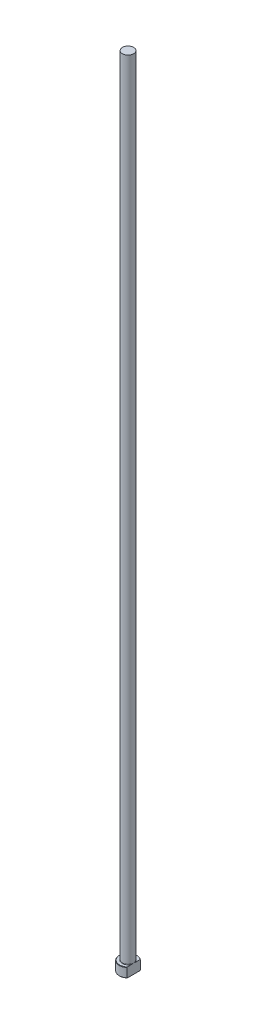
ISO-10303-21;
HEADER;
FILE_DESCRIPTION(('STEP AP214'),'2;1');
FILE_NAME('part.step','',(''),(''),'','','');
FILE_SCHEMA(('AUTOMOTIVE_DESIGN { 1 0 10303 214 1 1 1 1 }'));
ENDSEC;
DATA;
#1=APPLICATION_CONTEXT('core data for automotive mechanical design processes');
#2=APPLICATION_PROTOCOL_DEFINITION('international standard','automotive_design',2000,#1);
#3=PRODUCT_CONTEXT('',#1,'mechanical');
#4=PRODUCT('Part','Part','',(#3));
#5=PRODUCT_RELATED_PRODUCT_CATEGORY('part','',(#4));
#6=PRODUCT_DEFINITION_FORMATION('','',#4);
#7=PRODUCT_DEFINITION_CONTEXT('part definition',#1,'design');
#8=PRODUCT_DEFINITION('design','',#6,#7);
#9=PRODUCT_DEFINITION_SHAPE('','',#8);
#10=(LENGTH_UNIT() NAMED_UNIT(*) SI_UNIT(.MILLI.,.METRE.));
#11=(NAMED_UNIT(*) PLANE_ANGLE_UNIT() SI_UNIT($,.RADIAN.));
#12=(NAMED_UNIT(*) SI_UNIT($,.STERADIAN.) SOLID_ANGLE_UNIT());
#13=UNCERTAINTY_MEASURE_WITH_UNIT(LENGTH_MEASURE(1.E-05),#10,'distance_accuracy_value','');
#14=(GEOMETRIC_REPRESENTATION_CONTEXT(3) GLOBAL_UNCERTAINTY_ASSIGNED_CONTEXT((#13)) GLOBAL_UNIT_ASSIGNED_CONTEXT((#10,
#11,#12)) REPRESENTATION_CONTEXT('',''));
#15=CARTESIAN_POINT('',(0.,0.,0.));
#16=DIRECTION('',(0.,0.,1.));
#17=DIRECTION('',(1.,0.,0.));
#18=AXIS2_PLACEMENT_3D('',#15,#16,#17);
#19=CARTESIAN_POINT('',(0.,0.,0.));
#20=DIRECTION('',(0.,-1.,0.));
#21=DIRECTION('',(0.,0.,-1.));
#22=AXIS2_PLACEMENT_3D('',#19,#20,#21);
#23=PLANE('',#22);
#24=CARTESIAN_POINT('',(0.,0.,0.));
#25=DIRECTION('',(0.,-1.,0.));
#26=DIRECTION('',(0.,0.,-1.));
#27=AXIS2_PLACEMENT_3D('',#24,#25,#26);
#28=CIRCLE('',#27,5.29999999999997);
#29=CARTESIAN_POINT('',(3.49999999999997,0.,3.97994974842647));
#30=VERTEX_POINT('',#29);
#31=CARTESIAN_POINT('',(3.49999999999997,0.,-3.97994974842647));
#32=VERTEX_POINT('',#31);
#33=EDGE_CURVE('E98',#30,#32,#28,.T.);
#34=ORIENTED_EDGE('',*,*,#33,.T.);
#35=DIRECTION('',(0.,0.,1.));
#36=VECTOR('',#35,1.);
#37=CARTESIAN_POINT('',(3.49999999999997,0.,4.24264068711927));
#38=LINE('',#37,#36);
#39=EDGE_CURVE('E83',#32,#30,#38,.T.);
#40=ORIENTED_EDGE('',*,*,#39,.T.);
#41=EDGE_LOOP('',(#34,#40));
#42=FACE_BOUND('',#41,.T.);
#43=ADVANCED_FACE('F32',(#42),#23,.T.);
#44=CARTESIAN_POINT('',(0.,259.958771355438,0.));
#45=DIRECTION('',(0.,1.,0.));
#46=DIRECTION('',(0.,0.,1.));
#47=AXIS2_PLACEMENT_3D('',#44,#45,#46);
#48=CYLINDRICAL_SURFACE('',#47,5.49999999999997);
#49=CARTESIAN_POINT('',(0.,5.79999999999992,0.));
#50=DIRECTION('',(0.,1.,0.));
#51=DIRECTION('',(0.,0.,1.));
#52=AXIS2_PLACEMENT_3D('',#49,#50,#51);
#53=CIRCLE('',#52,5.49999999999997);
#54=CARTESIAN_POINT('',(3.49999999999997,5.79999999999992,4.24264068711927));
#55=VERTEX_POINT('',#54);
#56=CARTESIAN_POINT('',(3.49999999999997,5.79999999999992,-4.24264068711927));
#57=VERTEX_POINT('',#56);
#58=EDGE_CURVE('E104',#55,#57,#53,.F.);
#59=ORIENTED_EDGE('',*,*,#58,.T.);
#60=DIRECTION('',(0.,-1.,0.));
#61=VECTOR('',#60,1.);
#62=CARTESIAN_POINT('',(3.49999999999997,500.,-4.24264068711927));
#63=LINE('',#62,#61);
#64=CARTESIAN_POINT('',(3.49999999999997,0.199999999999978,-4.24264068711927));
#65=VERTEX_POINT('',#64);
#66=EDGE_CURVE('E183',#57,#65,#63,.T.);
#67=ORIENTED_EDGE('',*,*,#66,.T.);
#68=CARTESIAN_POINT('',(0.,0.199999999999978,0.));
#69=DIRECTION('',(0.,-1.,0.));
#70=DIRECTION('',(0.,0.,-1.));
#71=AXIS2_PLACEMENT_3D('',#68,#69,#70);
#72=CIRCLE('',#71,5.49999999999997);
#73=CARTESIAN_POINT('',(3.49999999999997,0.199999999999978,4.24264068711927));
#74=VERTEX_POINT('',#73);
#75=EDGE_CURVE('E100',#65,#74,#72,.F.);
#76=ORIENTED_EDGE('',*,*,#75,.T.);
#77=DIRECTION('',(0.,-1.,0.));
#78=VECTOR('',#77,1.);
#79=CARTESIAN_POINT('',(3.49999999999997,500.,4.24264068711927));
#80=LINE('',#79,#78);
#81=EDGE_CURVE('E93',#55,#74,#80,.T.);
#82=ORIENTED_EDGE('',*,*,#81,.F.);
#83=EDGE_LOOP('',(#59,#67,#76,#82));
#84=FACE_BOUND('',#83,.T.);
#85=ADVANCED_FACE('F158',(#84),#48,.T.);
#86=CARTESIAN_POINT('',(-5.49999999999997,6.,0.));
#87=DIRECTION('',(0.,1.,0.));
#88=DIRECTION('',(0.,0.,1.));
#89=AXIS2_PLACEMENT_3D('',#86,#87,#88);
#90=PLANE('',#89);
#91=CARTESIAN_POINT('',(0.,6.,0.));
#92=DIRECTION('',(0.,1.,0.));
#93=DIRECTION('',(0.,0.,1.));
#94=AXIS2_PLACEMENT_3D('',#91,#92,#93);
#95=CIRCLE('',#94,5.29999999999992);
#96=CARTESIAN_POINT('',(3.49999999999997,6.,-3.9799497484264));
#97=VERTEX_POINT('',#96);
#98=CARTESIAN_POINT('',(3.49999999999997,6.,3.9799497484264));
#99=VERTEX_POINT('',#98);
#100=EDGE_CURVE('E178',#97,#99,#95,.T.);
#101=ORIENTED_EDGE('',*,*,#100,.T.);
#102=DIRECTION('',(0.,0.,-1.));
#103=VECTOR('',#102,1.);
#104=CARTESIAN_POINT('',(3.49999999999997,6.,0.));
#105=LINE('',#104,#103);
#106=CARTESIAN_POINT('',(3.49999999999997,5.99999999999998,1.19999999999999));
#107=VERTEX_POINT('',#106);
#108=EDGE_CURVE('E57',#99,#107,#105,.T.);
#109=ORIENTED_EDGE('',*,*,#108,.T.);
#110=CARTESIAN_POINT('',(0.,6.,0.));
#111=DIRECTION('',(0.,1.,0.));
#112=DIRECTION('',(0.,0.,1.));
#113=AXIS2_PLACEMENT_3D('',#110,#111,#112);
#114=CIRCLE('',#113,3.69999999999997);
#115=CARTESIAN_POINT('',(3.49999999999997,5.99999999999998,-1.19999999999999));
#116=VERTEX_POINT('',#115);
#117=EDGE_CURVE('E107',#107,#116,#114,.F.);
#118=ORIENTED_EDGE('',*,*,#117,.T.);
#119=EDGE_CURVE('E136',#116,#97,#105,.T.);
#120=ORIENTED_EDGE('',*,*,#119,.T.);
#121=EDGE_LOOP('',(#101,#109,#118,#120));
#122=FACE_BOUND('',#121,.T.);
#123=ADVANCED_FACE('F147',(#122),#90,.T.);
#124=CARTESIAN_POINT('',(0.,6.00000000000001,0.));
#125=DIRECTION('',(0.,-1.,0.));
#126=DIRECTION('',(0.,0.,-1.));
#127=AXIS2_PLACEMENT_3D('',#124,#125,#126);
#128=CONICAL_SURFACE('',#127,5.29999999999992,0.785398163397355);
#129=ORIENTED_EDGE('',*,*,#58,.F.);
#130=CARTESIAN_POINT('',(3.49999999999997,1.33003849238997,9.33542352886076));
#131=CARTESIAN_POINT('',(3.49999999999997,1.466067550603,9.1901458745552));
#132=CARTESIAN_POINT('',(3.49999999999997,1.60189091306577,9.04467563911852));
#133=CARTESIAN_POINT('',(3.49999999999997,1.87305939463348,8.75328845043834));
#134=CARTESIAN_POINT('',(3.49999999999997,2.00840451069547,8.60737149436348));
#135=CARTESIAN_POINT('',(3.49999999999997,2.41368868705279,8.16878624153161));
#136=CARTESIAN_POINT('',(3.49999999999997,2.68280695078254,7.87535778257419));
#137=CARTESIAN_POINT('',(3.49999999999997,3.22029202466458,7.28335275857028));
#138=CARTESIAN_POINT('',(3.49999999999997,3.48863408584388,6.984753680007));
#139=CARTESIAN_POINT('',(3.49999999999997,4.02101445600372,6.38381794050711));
#140=CARTESIAN_POINT('',(3.49999999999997,4.28505346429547,6.08148190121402));
#141=CARTESIAN_POINT('',(3.49999999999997,4.76064644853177,5.52540485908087));
#142=CARTESIAN_POINT('',(3.49999999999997,4.97321621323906,5.27253724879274));
#143=CARTESIAN_POINT('',(3.49999999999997,5.28746532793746,4.88936279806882));
#144=CARTESIAN_POINT('',(3.49999999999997,5.39146981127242,4.76096380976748));
#145=CARTESIAN_POINT('',(3.49999999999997,5.59756866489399,4.50264388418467));
#146=CARTESIAN_POINT('',(3.49999999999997,5.69966308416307,4.372722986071));
#147=CARTESIAN_POINT('',(3.49999999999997,5.90129005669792,4.111322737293));
#148=CARTESIAN_POINT('',(3.49999999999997,6.00082737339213,3.97984706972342));
#149=CARTESIAN_POINT('',(3.49999999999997,6.19694716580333,3.71471559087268));
#150=CARTESIAN_POINT('',(3.49999999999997,6.29352983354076,3.58105992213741));
#151=CARTESIAN_POINT('',(3.49999999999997,6.48287386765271,3.3111853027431));
#152=CARTESIAN_POINT('',(3.49999999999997,6.57563763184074,3.17496804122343));
#153=CARTESIAN_POINT('',(3.49999999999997,6.75628267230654,2.89934683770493));
#154=CARTESIAN_POINT('',(3.49999999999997,6.844164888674,2.75994351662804));
#155=CARTESIAN_POINT('',(3.49999999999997,6.99814457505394,2.50290457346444));
#156=CARTESIAN_POINT('',(3.49999999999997,7.06530217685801,2.38590684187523));
#157=CARTESIAN_POINT('',(3.49999999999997,7.19416460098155,2.14890235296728));
#158=CARTESIAN_POINT('',(3.49999999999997,7.25586874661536,2.02889522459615));
#159=CARTESIAN_POINT('',(3.49999999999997,7.37226286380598,1.78564087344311));
#160=CARTESIAN_POINT('',(3.49999999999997,7.42695969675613,1.66239696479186));
#161=CARTESIAN_POINT('',(3.49999999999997,7.52751976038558,1.41233625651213));
#162=CARTESIAN_POINT('',(3.49999999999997,7.57338548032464,1.28552047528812));
#163=CARTESIAN_POINT('',(3.49999999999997,7.64556102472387,1.05555158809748));
#164=CARTESIAN_POINT('',(3.49999999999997,7.67395518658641,0.953056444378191));
#165=CARTESIAN_POINT('',(3.49999999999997,7.72275092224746,0.746191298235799));
#166=CARTESIAN_POINT('',(3.49999999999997,7.74315535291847,0.641821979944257));
#167=CARTESIAN_POINT('',(3.49999999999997,7.77495944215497,0.43200211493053));
#168=CARTESIAN_POINT('',(3.49999999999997,7.78638437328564,0.326555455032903));
#169=CARTESIAN_POINT('',(3.49999999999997,7.79969943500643,0.115055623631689));
#170=CARTESIAN_POINT('',(3.49999999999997,7.80158992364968,0.00900247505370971));
#171=CARTESIAN_POINT('',(3.49999999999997,7.7957232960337,-0.20296681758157));
#172=CARTESIAN_POINT('',(3.49999999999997,7.7879539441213,-0.308882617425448));
#173=CARTESIAN_POINT('',(3.49999999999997,7.76318672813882,-0.519620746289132));
#174=CARTESIAN_POINT('',(3.49999999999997,7.74618811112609,-0.624442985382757));
#175=CARTESIAN_POINT('',(3.49999999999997,7.70376319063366,-0.832676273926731));
#176=CARTESIAN_POINT('',(3.49999999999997,7.67831139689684,-0.936082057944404));
#177=CARTESIAN_POINT('',(3.49999999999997,7.62008719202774,-1.14078653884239));
#178=CARTESIAN_POINT('',(3.49999999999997,7.5873146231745,-1.24208519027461));
#179=CARTESIAN_POINT('',(3.49999999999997,7.50935793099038,-1.45980073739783));
#180=CARTESIAN_POINT('',(3.49999999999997,7.46300722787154,-1.57579699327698));
#181=CARTESIAN_POINT('',(3.49999999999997,7.36341881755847,-1.804802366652));
#182=CARTESIAN_POINT('',(3.49999999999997,7.31017881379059,-1.91781047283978));
#183=CARTESIAN_POINT('',(3.49999999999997,7.19809800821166,-2.14125149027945));
#184=CARTESIAN_POINT('',(3.49999999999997,7.13924715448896,-2.25167932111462));
#185=CARTESIAN_POINT('',(3.49999999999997,7.01714037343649,-2.4700355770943));
#186=CARTESIAN_POINT('',(3.49999999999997,6.95388506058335,-2.57796434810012));
#187=CARTESIAN_POINT('',(3.49999999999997,6.82298676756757,-2.79303108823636));
#188=CARTESIAN_POINT('',(3.49999999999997,6.75529770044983,-2.90014087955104));
#189=CARTESIAN_POINT('',(3.49999999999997,6.61696954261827,-3.11243359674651));
#190=CARTESIAN_POINT('',(3.49999999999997,6.54633037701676,-3.21761647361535));
#191=CARTESIAN_POINT('',(3.49999999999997,6.33097773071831,-3.53046033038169));
#192=CARTESIAN_POINT('',(3.49999999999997,6.18268185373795,-3.73565296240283));
#193=CARTESIAN_POINT('',(3.49999999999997,5.84686519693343,-4.18490964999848));
#194=CARTESIAN_POINT('',(3.49999999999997,5.65778936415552,-4.42779920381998));
#195=CARTESIAN_POINT('',(3.49999999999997,5.27320376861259,-4.9084592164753));
#196=CARTESIAN_POINT('',(3.49999999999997,5.07769298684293,-5.14622885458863));
#197=CARTESIAN_POINT('',(3.49999999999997,4.68199594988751,-5.61823063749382));
#198=CARTESIAN_POINT('',(3.49999999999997,4.48180526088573,-5.85245905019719));
#199=CARTESIAN_POINT('',(3.49999999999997,4.07816705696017,-6.31809464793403));
#200=CARTESIAN_POINT('',(3.49999999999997,3.87471946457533,-6.54950176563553));
#201=CARTESIAN_POINT('',(3.49999999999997,3.47805105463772,-6.99590528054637));
#202=CARTESIAN_POINT('',(3.49999999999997,3.28497598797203,-7.21103144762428));
#203=CARTESIAN_POINT('',(3.49999999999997,2.89715235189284,-7.63977694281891));
#204=CARTESIAN_POINT('',(3.49999999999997,2.70240374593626,-7.85339623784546));
#205=CARTESIAN_POINT('',(3.49999999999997,2.31198639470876,-8.27898344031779));
#206=CARTESIAN_POINT('',(3.49999999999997,2.11632036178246,-8.49095383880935));
#207=CARTESIAN_POINT('',(3.49999999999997,1.72392141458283,-8.91388826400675));
#208=CARTESIAN_POINT('',(3.49999999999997,1.52718854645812,-9.12485233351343));
#209=CARTESIAN_POINT('',(3.49999999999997,1.33003849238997,-9.33542352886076));
#210=B_SPLINE_CURVE_WITH_KNOTS('',3,(#130,#131,#132,#133,#134,#135,#136,#137,#138,#139,#140,
#141,#142,#143,#144,#145,#146,#147,#148,#149,#150,#151,#152,#153,#154,#155,#156,#157,#158,#159,
#160,#161,#162,#163,#164,#165,#166,#167,#168,#169,#170,#171,#172,#173,#174,#175,#176,#177,#178,
#179,#180,#181,#182,#183,#184,#185,#186,#187,#188,#189,#190,#191,#192,#193,#194,#195,#196,#197,
#198,#199,#200,#201,#202,#203,#204,#205,#206,#207,#208,#209),.UNSPECIFIED.,.F.,.F.,(4,2,2,2,2,2,
2,2,2,2,2,2,2,2,2,2,2,2,2,2,2,2,2,2,2,2,2,2,2,2,2,2,2,2,2,2,2,2,2,4),(0.,0.597063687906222,
1.19413116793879,2.3885714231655,3.59291920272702,4.79706926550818,5.78802649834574,
6.28372320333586,6.77940717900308,7.27408870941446,7.76873802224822,8.26307186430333,
8.7573101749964,9.1619047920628,9.56654954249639,9.97079499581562,10.374926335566,
10.6937207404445,11.0124010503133,11.3301811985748,11.6479494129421,11.9661205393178,
12.2843176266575,12.6034830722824,12.9226553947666,13.2971137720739,13.6716972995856,
14.0469649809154,14.4221804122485,14.80223780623,15.1823048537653,15.9416042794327,
16.8648705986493,17.7882838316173,18.7126105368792,19.6369592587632,20.5041367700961,
21.3713332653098,22.2367481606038,23.1021259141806),.UNSPECIFIED.);
#211=EDGE_CURVE('E135',#55,#99,#210,.T.);
#212=ORIENTED_EDGE('',*,*,#211,.T.);
#213=ORIENTED_EDGE('',*,*,#100,.F.);
#214=EDGE_CURVE('E127',#97,#57,#210,.T.);
#215=ORIENTED_EDGE('',*,*,#214,.T.);
#216=EDGE_LOOP('',(#129,#212,#213,#215));
#217=FACE_BOUND('',#216,.T.);
#218=ADVANCED_FACE('F143',(#217),#128,.T.);
#219=CARTESIAN_POINT('',(0.,0.199999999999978,0.));
#220=DIRECTION('',(0.,1.,0.));
#221=DIRECTION('',(0.,0.,1.));
#222=AXIS2_PLACEMENT_3D('',#219,#220,#221);
#223=CONICAL_SURFACE('',#222,5.49999999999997,0.785398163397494);
#224=ORIENTED_EDGE('',*,*,#75,.F.);
#225=CARTESIAN_POINT('',(3.49999999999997,4.66996150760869,-9.33542352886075));
#226=CARTESIAN_POINT('',(3.49999999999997,4.53393244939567,-9.19014587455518));
#227=CARTESIAN_POINT('',(3.49999999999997,4.39810908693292,-9.04467563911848));
#228=CARTESIAN_POINT('',(3.49999999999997,4.12694060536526,-8.75328845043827));
#229=CARTESIAN_POINT('',(3.49999999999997,3.99159548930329,-8.60737149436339));
#230=CARTESIAN_POINT('',(3.49999999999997,3.58631131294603,-8.16878624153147));
#231=CARTESIAN_POINT('',(3.49999999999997,3.31719304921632,-7.87535778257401));
#232=CARTESIAN_POINT('',(3.49999999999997,2.77970797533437,-7.28335275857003));
#233=CARTESIAN_POINT('',(3.49999999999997,2.5113659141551,-6.9847536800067));
#234=CARTESIAN_POINT('',(3.49999999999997,1.97898554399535,-6.38381794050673));
#235=CARTESIAN_POINT('',(3.49999999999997,1.71494653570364,-6.08148190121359));
#236=CARTESIAN_POINT('',(3.49999999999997,1.2393535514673,-5.52540485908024));
#237=CARTESIAN_POINT('',(3.49999999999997,1.02678378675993,-5.27253724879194));
#238=CARTESIAN_POINT('',(3.49999999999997,0.712534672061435,-4.88936279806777));
#239=CARTESIAN_POINT('',(3.49999999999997,0.608530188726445,-4.76096380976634));
#240=CARTESIAN_POINT('',(3.49999999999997,0.40243133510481,-4.50264388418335));
#241=CARTESIAN_POINT('',(3.49999999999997,0.300336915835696,-4.3727229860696));
#242=CARTESIAN_POINT('',(3.49999999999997,0.0987099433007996,-4.11132273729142));
#243=CARTESIAN_POINT('',(3.49999999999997,-0.000827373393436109,-3.97984706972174));
#244=CARTESIAN_POINT('',(3.49999999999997,-0.196947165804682,-3.71471559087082));
#245=CARTESIAN_POINT('',(3.49999999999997,-0.293529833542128,-3.58105992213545));
#246=CARTESIAN_POINT('',(3.49999999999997,-0.482873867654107,-3.31118530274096));
#247=CARTESIAN_POINT('',(3.49999999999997,-0.575637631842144,-3.17496804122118));
#248=CARTESIAN_POINT('',(3.49999999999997,-0.756282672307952,-2.89934683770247));
#249=CARTESIAN_POINT('',(3.49999999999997,-0.844164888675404,-2.75994351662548));
#250=CARTESIAN_POINT('',(3.49999999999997,-0.998144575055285,-2.50290457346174));
#251=CARTESIAN_POINT('',(3.49999999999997,-1.0653021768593,-2.3859068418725));
#252=CARTESIAN_POINT('',(3.49999999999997,-1.19416460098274,-2.14890235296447));
#253=CARTESIAN_POINT('',(3.49999999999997,-1.25586874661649,-2.02889522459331));
#254=CARTESIAN_POINT('',(3.49999999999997,-1.37226286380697,-1.7856408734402));
#255=CARTESIAN_POINT('',(3.49999999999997,-1.42695969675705,-1.66239696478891));
#256=CARTESIAN_POINT('',(3.49999999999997,-1.52751976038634,-1.41233625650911));
#257=CARTESIAN_POINT('',(3.49999999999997,-1.57338548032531,-1.28552047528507));
#258=CARTESIAN_POINT('',(3.49999999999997,-1.64556102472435,-1.05555158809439));
#259=CARTESIAN_POINT('',(3.49999999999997,-1.67395518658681,-0.953056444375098));
#260=CARTESIAN_POINT('',(3.49999999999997,-1.72275092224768,-0.746191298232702));
#261=CARTESIAN_POINT('',(3.49999999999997,-1.7431553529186,-0.641821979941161));
#262=CARTESIAN_POINT('',(3.49999999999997,-1.7749594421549,-0.432002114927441));
#263=CARTESIAN_POINT('',(3.49999999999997,-1.78638437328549,-0.326555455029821));
#264=CARTESIAN_POINT('',(3.49999999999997,-1.79969943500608,-0.11505562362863));
#265=CARTESIAN_POINT('',(3.49999999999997,-1.80158992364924,-0.00900247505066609));
#266=CARTESIAN_POINT('',(3.49999999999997,-1.79572329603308,0.202966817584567));
#267=CARTESIAN_POINT('',(3.49999999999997,-1.78795394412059,0.308882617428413));
#268=CARTESIAN_POINT('',(3.49999999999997,-1.76318672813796,0.51962074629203));
#269=CARTESIAN_POINT('',(3.49999999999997,-1.74618811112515,0.624442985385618));
#270=CARTESIAN_POINT('',(3.49999999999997,-1.70376319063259,0.832676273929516));
#271=CARTESIAN_POINT('',(3.49999999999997,-1.67831139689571,0.936082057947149));
#272=CARTESIAN_POINT('',(3.49999999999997,-1.62008719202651,1.14078653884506));
#273=CARTESIAN_POINT('',(3.49999999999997,-1.58731462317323,1.24208519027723));
#274=CARTESIAN_POINT('',(3.49999999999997,-1.50935793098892,1.45980073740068));
#275=CARTESIAN_POINT('',(3.49999999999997,-1.46300722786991,1.5757969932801));
#276=CARTESIAN_POINT('',(3.49999999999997,-1.36341881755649,1.80480236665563));
#277=CARTESIAN_POINT('',(3.49999999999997,-1.31017881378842,1.91781047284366));
#278=CARTESIAN_POINT('',(3.49999999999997,-1.1980980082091,2.14125149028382));
#279=CARTESIAN_POINT('',(3.49999999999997,-1.1392471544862,2.25167932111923));
#280=CARTESIAN_POINT('',(3.49999999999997,-1.01714037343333,2.47003557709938));
#281=CARTESIAN_POINT('',(3.49999999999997,-0.953885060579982,2.57796434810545));
#282=CARTESIAN_POINT('',(3.49999999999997,-0.822986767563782,2.79303108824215));
#283=CARTESIAN_POINT('',(3.49999999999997,-0.755297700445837,2.90014087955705));
#284=CARTESIAN_POINT('',(3.49999999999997,-0.616969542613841,3.11243359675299));
#285=CARTESIAN_POINT('',(3.49999999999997,-0.546330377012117,3.21761647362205));
#286=CARTESIAN_POINT('',(3.49999999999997,-0.330977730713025,3.53046033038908));
#287=CARTESIAN_POINT('',(3.49999999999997,-0.182681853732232,3.73565296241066));
#288=CARTESIAN_POINT('',(3.49999999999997,0.153134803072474,4.18490965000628));
#289=CARTESIAN_POINT('',(3.49999999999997,0.342210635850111,4.42779920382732));
#290=CARTESIAN_POINT('',(3.49999999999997,0.726796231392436,4.90845921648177));
#291=CARTESIAN_POINT('',(3.49999999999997,0.922307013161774,5.14622885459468));
#292=CARTESIAN_POINT('',(3.49999999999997,1.31800405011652,5.61823063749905));
#293=CARTESIAN_POINT('',(3.49999999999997,1.51819473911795,5.85245905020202));
#294=CARTESIAN_POINT('',(3.49999999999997,1.92183294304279,6.31809464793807));
#295=CARTESIAN_POINT('',(3.49999999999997,2.12528053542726,6.54950176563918));
#296=CARTESIAN_POINT('',(3.49999999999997,2.52194894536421,6.99590528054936));
#297=CARTESIAN_POINT('',(3.49999999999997,2.7150240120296,7.21103144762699));
#298=CARTESIAN_POINT('',(3.49999999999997,3.10284764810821,7.63977694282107));
#299=CARTESIAN_POINT('',(3.49999999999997,3.29759625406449,7.85339623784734));
#300=CARTESIAN_POINT('',(3.49999999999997,3.6880136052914,8.27898344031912));
#301=CARTESIAN_POINT('',(3.49999999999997,3.88367963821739,8.49095383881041));
#302=CARTESIAN_POINT('',(3.49999999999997,4.27607858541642,8.91388826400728));
#303=CARTESIAN_POINT('',(3.49999999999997,4.47281145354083,9.1248523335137));
#304=CARTESIAN_POINT('',(3.49999999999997,4.66996150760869,9.33542352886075));
#305=B_SPLINE_CURVE_WITH_KNOTS('',3,(#225,#226,#227,#228,#229,#230,#231,#232,#233,#234,#235,
#236,#237,#238,#239,#240,#241,#242,#243,#244,#245,#246,#247,#248,#249,#250,#251,#252,#253,#254,
#255,#256,#257,#258,#259,#260,#261,#262,#263,#264,#265,#266,#267,#268,#269,#270,#271,#272,#273,
#274,#275,#276,#277,#278,#279,#280,#281,#282,#283,#284,#285,#286,#287,#288,#289,#290,#291,#292,
#293,#294,#295,#296,#297,#298,#299,#300,#301,#302,#303,#304),.UNSPECIFIED.,.F.,.F.,(4,2,2,2,2,2,
2,2,2,2,2,2,2,2,2,2,2,2,2,2,2,2,2,2,2,2,2,2,2,2,2,2,2,2,2,2,2,2,2,4),(0.,0.597063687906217,
1.19413116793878,2.38857142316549,3.59291920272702,4.79706926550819,5.78802649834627,
6.28372320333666,6.77940717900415,7.27408870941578,7.76873802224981,8.26307186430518,
8.75731017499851,9.16190479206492,9.56654954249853,9.97079499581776,10.3749263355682,
10.6937207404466,11.0124010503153,11.3301811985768,11.647949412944,11.9661205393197,
12.2843176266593,12.6034830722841,12.9226553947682,13.2971137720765,13.6716972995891,
14.0469649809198,14.4221804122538,14.8022378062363,15.1823048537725,15.9416042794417,
16.8648705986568,17.7882838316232,18.7126105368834,19.6369592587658,20.5041367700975,
21.37133326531,22.2367481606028,23.1021259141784),.UNSPECIFIED.);
#306=EDGE_CURVE('E86',#65,#32,#305,.T.);
#307=ORIENTED_EDGE('',*,*,#306,.T.);
#308=ORIENTED_EDGE('',*,*,#33,.F.);
#309=EDGE_CURVE('E89',#30,#74,#305,.T.);
#310=ORIENTED_EDGE('',*,*,#309,.T.);
#311=EDGE_LOOP('',(#224,#307,#308,#310));
#312=FACE_BOUND('',#311,.T.);
#313=ADVANCED_FACE('F97',(#312),#223,.T.);
#314=CARTESIAN_POINT('',(0.,6.19999999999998,0.));
#315=DIRECTION('',(0.,1.,0.));
#316=DIRECTION('',(0.,0.,1.));
#317=AXIS2_PLACEMENT_3D('',#314,#315,#316);
#318=TOROIDAL_SURFACE('',#317,3.69999999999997,0.2);
#319=CARTESIAN_POINT('',(3.49999999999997,6.19999999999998,0.));
#320=CARTESIAN_POINT('',(3.49999999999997,6.20000050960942,9.9809354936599E-11));
#321=CARTESIAN_POINT('',(3.49999999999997,6.20000101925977,-2.1348674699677E-07));
#322=CARTESIAN_POINT('',(3.49999999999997,6.20000196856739,-7.95759129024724E-07));
#323=CARTESIAN_POINT('',(3.49999999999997,6.20000239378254,-1.17925839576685E-06));
#324=CARTESIAN_POINT('',(3.49999999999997,6.20000328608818,-2.10014972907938E-06));
#325=CARTESIAN_POINT('',(3.49999999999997,6.20000373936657,-2.65249908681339E-06));
#326=CARTESIAN_POINT('',(3.49999999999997,6.20000454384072,-3.7911288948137E-06));
#327=CARTESIAN_POINT('',(3.49999999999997,6.20000489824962,-4.37533521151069E-06));
#328=CARTESIAN_POINT('',(3.49999999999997,6.20000623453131,-6.66270059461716E-06));
#329=CARTESIAN_POINT('',(3.49999999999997,6.20000714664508,-8.40961025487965E-06));
#330=CARTESIAN_POINT('',(3.49999999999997,6.20000862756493,-1.18496824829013E-05));
#331=CARTESIAN_POINT('',(3.49999999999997,6.20000922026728,-1.3532954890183E-05));
#332=CARTESIAN_POINT('',(3.49999999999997,6.20001174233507,-2.07268950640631E-05));
#333=CARTESIAN_POINT('',(3.49999999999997,6.20001365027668,-2.62477536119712E-05));
#334=CARTESIAN_POINT('',(3.49999999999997,6.20001642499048,-3.66274572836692E-05));
#335=CARTESIAN_POINT('',(3.49999999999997,6.20001740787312,-4.14549355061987E-05));
#336=CARTESIAN_POINT('',(3.49999999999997,6.20002462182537,-7.75352102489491E-05));
#337=CARTESIAN_POINT('',(3.49999999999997,6.20003014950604,-0.000108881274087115));
#338=CARTESIAN_POINT('',(3.49999999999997,6.20005434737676,-0.000233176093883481));
#339=CARTESIAN_POINT('',(3.49999999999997,6.20007737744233,-0.000325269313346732));
#340=CARTESIAN_POINT('',(3.49999999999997,6.20016742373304,-0.000691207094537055));
#341=CARTESIAN_POINT('',(3.49999999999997,6.20023166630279,-0.000965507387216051));
#342=CARTESIAN_POINT('',(3.49999999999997,6.20048971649,-0.00205944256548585));
#343=CARTESIAN_POINT('',(3.49999999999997,6.20068705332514,-0.00287847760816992));
#344=CARTESIAN_POINT('',(3.49999999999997,6.20150941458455,-0.00630050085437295));
#345=CARTESIAN_POINT('',(3.49999999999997,6.20212997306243,-0.00890424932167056));
#346=CARTESIAN_POINT('',(3.49999999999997,6.2070391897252,-0.0294912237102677));
#347=CARTESIAN_POINT('',(3.49999999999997,6.2113430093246,-0.047471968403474));
#348=CARTESIAN_POINT('',(3.49999999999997,6.21975360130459,-0.082719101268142));
#349=CARTESIAN_POINT('',(3.49999999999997,6.22386136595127,-0.0999852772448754));
#350=CARTESIAN_POINT('',(3.49999999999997,6.2372401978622,-0.156405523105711));
#351=CARTESIAN_POINT('',(3.49999999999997,6.24645854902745,-0.195572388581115));
#352=CARTESIAN_POINT('',(3.49999999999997,6.26203234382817,-0.262828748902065));
#353=CARTESIAN_POINT('',(3.49999999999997,6.26845671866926,-0.290902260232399));
#354=CARTESIAN_POINT('',(3.49999999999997,6.28094671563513,-0.346379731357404));
#355=CARTESIAN_POINT('',(3.49999999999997,6.28701730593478,-0.373782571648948));
#356=CARTESIAN_POINT('',(3.49999999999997,6.30077691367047,-0.437211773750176));
#357=CARTESIAN_POINT('',(3.49999999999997,6.3083789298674,-0.473257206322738));
#358=CARTESIAN_POINT('',(3.49999999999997,6.32309409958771,-0.545736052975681));
#359=CARTESIAN_POINT('',(3.49999999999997,6.33020304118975,-0.582170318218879));
#360=CARTESIAN_POINT('',(3.49999999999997,6.35161649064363,-0.697757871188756));
#361=CARTESIAN_POINT('',(3.49999999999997,6.36463967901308,-0.777158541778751));
#362=CARTESIAN_POINT('',(3.49999999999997,6.3843837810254,-0.92756184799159));
#363=CARTESIAN_POINT('',(3.49999999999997,6.39165512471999,-0.998486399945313));
#364=CARTESIAN_POINT('',(3.49999999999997,6.3979989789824,-1.10437287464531));
#365=CARTESIAN_POINT('',(3.49999999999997,6.39936233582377,-1.13919451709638));
#366=CARTESIAN_POINT('',(3.49999999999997,6.40028946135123,-1.20885098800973));
#367=CARTESIAN_POINT('',(3.49999999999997,6.39985418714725,-1.24368579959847));
#368=CARTESIAN_POINT('',(3.49999999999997,6.39686573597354,-1.30963279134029));
#369=CARTESIAN_POINT('',(3.49999999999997,6.39453835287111,-1.34075403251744));
#370=CARTESIAN_POINT('',(3.49999999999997,6.38750048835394,-1.40298456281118));
#371=CARTESIAN_POINT('',(3.49999999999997,6.38277118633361,-1.43409178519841));
#372=CARTESIAN_POINT('',(3.49999999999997,6.37000596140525,-1.49609278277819));
#373=CARTESIAN_POINT('',(3.49999999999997,6.36193044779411,-1.52697933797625));
#374=CARTESIAN_POINT('',(3.49999999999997,6.34614337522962,-1.57192957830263));
#375=CARTESIAN_POINT('',(3.49999999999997,6.3402919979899,-1.5866404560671));
#376=CARTESIAN_POINT('',(3.49999999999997,6.32701491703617,-1.6153215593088));
#377=CARTESIAN_POINT('',(3.49999999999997,6.31959341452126,-1.6292936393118));
#378=CARTESIAN_POINT('',(3.49999999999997,6.30547056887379,-1.65150372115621));
#379=CARTESIAN_POINT('',(3.49999999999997,6.29934759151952,-1.6601058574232));
#380=CARTESIAN_POINT('',(3.49999999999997,6.28595656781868,-1.67637400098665));
#381=CARTESIAN_POINT('',(3.49999999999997,6.27869146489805,-1.68404232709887));
#382=CARTESIAN_POINT('',(3.49999999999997,6.26587375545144,-1.69518467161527));
#383=CARTESIAN_POINT('',(3.49999999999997,6.26073958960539,-1.69913647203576));
#384=CARTESIAN_POINT('',(3.49999999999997,6.24994100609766,-1.70624293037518));
#385=CARTESIAN_POINT('',(3.49999999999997,6.24427723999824,-1.70939855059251));
#386=CARTESIAN_POINT('',(3.49999999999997,6.23351378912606,-1.71418736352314));
#387=CARTESIAN_POINT('',(3.49999999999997,6.22849079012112,-1.71599090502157));
#388=CARTESIAN_POINT('',(3.49999999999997,6.21821361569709,-1.71873268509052));
#389=CARTESIAN_POINT('',(3.49999999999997,6.21295968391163,-1.71967181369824));
#390=CARTESIAN_POINT('',(3.49999999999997,6.20234462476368,-1.72059432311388));
#391=CARTESIAN_POINT('',(3.49999999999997,6.19698314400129,-1.72057373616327));
#392=CARTESIAN_POINT('',(3.49999999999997,6.18635093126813,-1.71956893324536));
#393=CARTESIAN_POINT('',(3.49999999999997,6.18108024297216,-1.71858426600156));
#394=CARTESIAN_POINT('',(3.49999999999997,6.17106869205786,-1.71582968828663));
#395=CARTESIAN_POINT('',(3.49999999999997,6.16631466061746,-1.71410641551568));
#396=CARTESIAN_POINT('',(3.49999999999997,6.15709718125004,-1.71001459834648));
#397=CARTESIAN_POINT('',(3.49999999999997,6.15263381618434,-1.70764587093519));
#398=CARTESIAN_POINT('',(3.49999999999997,6.14110717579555,-1.70060771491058));
#399=CARTESIAN_POINT('',(3.49999999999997,6.13433222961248,-1.69546710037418));
#400=CARTESIAN_POINT('',(3.49999999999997,6.12164557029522,-1.68420869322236));
#401=CARTESIAN_POINT('',(3.49999999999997,6.11573697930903,-1.67808752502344));
#402=CARTESIAN_POINT('',(3.49999999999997,6.10028952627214,-1.66008531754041));
#403=CARTESIAN_POINT('',(3.49999999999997,6.09159238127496,-1.64748936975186));
#404=CARTESIAN_POINT('',(3.49999999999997,6.07604019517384,-1.62125022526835));
#405=CARTESIAN_POINT('',(3.49999999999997,6.06918749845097,-1.60760572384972));
#406=CARTESIAN_POINT('',(3.49999999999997,6.05635908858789,-1.57851190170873));
#407=CARTESIAN_POINT('',(3.49999999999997,6.05050870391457,-1.56300807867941));
#408=CARTESIAN_POINT('',(3.49999999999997,6.04009412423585,-1.53156759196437));
#409=CARTESIAN_POINT('',(3.49999999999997,6.03553147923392,-1.51563043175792));
#410=CARTESIAN_POINT('',(3.49999999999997,6.02331191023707,-1.46712048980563));
#411=CARTESIAN_POINT('',(3.49999999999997,6.01724153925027,-1.4341495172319));
#412=CARTESIAN_POINT('',(3.49999999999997,6.00883071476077,-1.37348993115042));
#413=CARTESIAN_POINT('',(3.49999999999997,6.00603148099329,-1.34585663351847));
#414=CARTESIAN_POINT('',(3.49999999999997,6.00204762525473,-1.29046925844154));
#415=CARTESIAN_POINT('',(3.49999999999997,6.00086336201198,-1.26271515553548));
#416=CARTESIAN_POINT('',(3.49999999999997,5.99925913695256,-1.17922229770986));
#417=CARTESIAN_POINT('',(3.49999999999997,6.00080993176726,-1.1234488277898));
#418=CARTESIAN_POINT('',(3.49999999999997,6.00738569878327,-1.01528124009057));
#419=CARTESIAN_POINT('',(3.49999999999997,6.01221131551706,-0.962872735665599));
#420=CARTESIAN_POINT('',(3.49999999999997,6.02425367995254,-0.858750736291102));
#421=CARTESIAN_POINT('',(3.49999999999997,6.03145152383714,-0.807035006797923));
#422=CARTESIAN_POINT('',(3.49999999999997,6.04786442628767,-0.702500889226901));
#423=CARTESIAN_POINT('',(3.49999999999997,6.05712869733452,-0.649690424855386));
#424=CARTESIAN_POINT('',(3.49999999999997,6.07730630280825,-0.542969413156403));
#425=CARTESIAN_POINT('',(3.49999999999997,6.08825618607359,-0.489065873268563));
#426=CARTESIAN_POINT('',(3.49999999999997,6.10770336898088,-0.397738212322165));
#427=CARTESIAN_POINT('',(3.49999999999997,6.11594150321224,-0.360258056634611));
#428=CARTESIAN_POINT('',(3.49999999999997,6.1326812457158,-0.285797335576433));
#429=CARTESIAN_POINT('',(3.49999999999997,6.14117887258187,-0.248815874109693));
#430=CARTESIAN_POINT('',(3.49999999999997,6.15740628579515,-0.179140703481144));
#431=CARTESIAN_POINT('',(3.49999999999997,6.1651124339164,-0.146441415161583));
#432=CARTESIAN_POINT('',(3.49999999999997,6.18096853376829,-0.0796648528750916));
#433=CARTESIAN_POINT('',(3.49999999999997,6.18912333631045,-0.0455886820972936));
#434=CARTESIAN_POINT('',(3.49999999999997,6.19787118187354,-0.00889903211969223));
#435=CARTESIAN_POINT('',(3.49999999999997,6.19849305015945,-0.00629009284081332));
#436=CARTESIAN_POINT('',(3.49999999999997,6.19931571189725,-0.00286690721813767));
#437=CARTESIAN_POINT('',(3.49999999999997,6.19951207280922,-0.00205190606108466));
#438=CARTESIAN_POINT('',(3.49999999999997,6.19976893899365,-0.000962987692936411));
#439=CARTESIAN_POINT('',(3.49999999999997,6.19983295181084,-0.000689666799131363));
#440=CARTESIAN_POINT('',(3.49999999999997,6.19992272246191,-0.000324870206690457));
#441=CARTESIAN_POINT('',(3.49999999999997,6.19994571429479,-0.000232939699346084));
#442=CARTESIAN_POINT('',(3.49999999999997,6.19996987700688,-0.000108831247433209));
#443=CARTESIAN_POINT('',(3.49999999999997,6.19997540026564,-7.75074375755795E-05));
#444=CARTESIAN_POINT('',(3.49999999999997,6.19998260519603,-4.14499502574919E-05));
#445=CARTESIAN_POINT('',(3.49999999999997,6.19998358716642,-3.66236562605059E-05));
#446=CARTESIAN_POINT('',(3.49999999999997,6.19998635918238,-2.62464271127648E-05));
#447=CARTESIAN_POINT('',(3.49999999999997,6.19998826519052,-2.07267962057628E-05));
#448=CARTESIAN_POINT('',(3.49999999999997,6.19999078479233,-1.35341428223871E-05));
#449=CARTESIAN_POINT('',(3.49999999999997,6.19999137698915,-1.18509583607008E-05));
#450=CARTESIAN_POINT('',(3.49999999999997,6.19999285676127,-8.41098341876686E-06));
#451=CARTESIAN_POINT('',(3.49999999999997,6.19999376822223,-6.66407126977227E-06));
#452=CARTESIAN_POINT('',(3.49999999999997,6.19999510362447,-4.37661194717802E-06));
#453=CARTESIAN_POINT('',(3.49999999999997,6.19999545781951,-3.79235333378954E-06));
#454=CARTESIAN_POINT('',(3.49999999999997,6.19999626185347,-2.65358032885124E-06));
#455=CARTESIAN_POINT('',(3.49999999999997,6.19999671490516,-2.10113839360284E-06));
#456=CARTESIAN_POINT('',(3.49999999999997,6.1999976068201,-1.18003190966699E-06));
#457=CARTESIAN_POINT('',(3.49999999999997,6.19999803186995,-7.964187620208E-07));
#458=CARTESIAN_POINT('',(3.49999999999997,6.19999898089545,-2.13855187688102E-07));
#459=CARTESIAN_POINT('',(3.49999999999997,6.19999949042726,-9.98021657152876E-11));
#460=CARTESIAN_POINT('',(3.49999999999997,6.19999999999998,0.));
#461=B_SPLINE_CURVE_WITH_KNOTS('',3,(#319,#320,#321,#322,#323,#324,#325,#326,#327,#328,#329,
#330,#331,#332,#333,#334,#335,#336,#337,#338,#339,#340,#341,#342,#343,#344,#345,#346,#347,#348,
#349,#350,#351,#352,#353,#354,#355,#356,#357,#358,#359,#360,#361,#362,#363,#364,#365,#366,#367,
#368,#369,#370,#371,#372,#373,#374,#375,#376,#377,#378,#379,#380,#381,#382,#383,#384,#385,#386,
#387,#388,#389,#390,#391,#392,#393,#394,#395,#396,#397,#398,#399,#400,#401,#402,#403,#404,#405,
#406,#407,#408,#409,#410,#411,#412,#413,#414,#415,#416,#417,#418,#419,#420,#421,#422,#423,#424,
#425,#426,#427,#428,#429,#430,#431,#432,#433,#434,#435,#436,#437,#438,#439,#440,#441,#442,#443,
#444,#445,#446,#447,#448,#449,#450,#451,#452,#453,#454,#455,#456,#457,#458,#459,#460),
.UNSPECIFIED.,.T.,.F.,(4,2,2,2,2,2,2,2,2,2,2,2,2,2,2,2,2,2,2,2,2,2,2,2,2,2,2,2,2,2,2,2,2,2,2,2,
2,2,2,2,2,2,2,2,2,2,2,2,2,2,2,2,2,2,2,2,2,2,2,2,2,2,2,2,2,2,2,2,2,2,4),(0.,1.54778905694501E-06,
3.27068856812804E-06,5.40032147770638E-06,7.44938901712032E-06,1.33412905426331E-05,
1.86900588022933E-05,3.61865044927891E-05,5.09488028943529E-05,0.000146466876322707,
0.000431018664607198,0.001276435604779,0.00380354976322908,0.0118339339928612,
0.0672984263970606,0.120543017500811,0.24125328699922,0.327650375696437,0.411851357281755,
0.52236238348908,0.633723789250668,0.875007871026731,1.08869711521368,1.19320699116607,
1.29766126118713,1.39121331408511,1.4855099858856,1.58095571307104,1.62839133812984,
1.67570160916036,1.70731126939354,1.73884076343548,1.75822424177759,1.77758417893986,
1.79352969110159,1.80945876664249,1.82545370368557,1.84145613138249,1.8565700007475,
1.8716881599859,1.89705349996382,1.92250811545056,1.96816999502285,2.01388964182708,
2.06352392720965,2.11321770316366,2.21356505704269,2.29684564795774,2.3801447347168,
2.54733140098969,2.70515844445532,2.86175703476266,3.02258329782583,3.18758220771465,
3.30270498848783,3.41653913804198,3.51732480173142,3.62243689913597,3.63048332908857,
3.63299799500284,3.63384039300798,3.63412444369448,3.6342198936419,3.63423465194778,
3.63425214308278,3.63425749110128,3.63426338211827,3.63426543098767,3.63426756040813,
3.63426928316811,3.63427083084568),.UNSPECIFIED.);
#462=CARTESIAN_POINT('',(3.49999999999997,6.19999999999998,0.));
#463=VERTEX_POINT('',#462);
#464=EDGE_CURVE('E11',#116,#463,#461,.T.);
#465=ORIENTED_EDGE('',*,*,#464,.F.);
#466=ORIENTED_EDGE('',*,*,#117,.F.);
#467=CARTESIAN_POINT('',(3.49999999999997,6.19999999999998,0.));
#468=CARTESIAN_POINT('',(3.49999999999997,6.19999949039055,-9.98097226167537E-11));
#469=CARTESIAN_POINT('',(3.49999999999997,6.1999989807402,2.13486746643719E-07));
#470=CARTESIAN_POINT('',(3.49999999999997,6.19999803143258,7.95759128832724E-07));
#471=CARTESIAN_POINT('',(3.49999999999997,6.19999760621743,1.17925839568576E-06));
#472=CARTESIAN_POINT('',(3.49999999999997,6.19999671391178,2.10014972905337E-06));
#473=CARTESIAN_POINT('',(3.49999999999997,6.19999626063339,2.65249908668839E-06));
#474=CARTESIAN_POINT('',(3.49999999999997,6.19999545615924,3.79112889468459E-06));
#475=CARTESIAN_POINT('',(3.49999999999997,6.19999510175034,4.37533521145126E-06));
#476=CARTESIAN_POINT('',(3.49999999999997,6.19999376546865,6.66270059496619E-06));
#477=CARTESIAN_POINT('',(3.49999999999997,6.19999285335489,8.4096102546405E-06));
#478=CARTESIAN_POINT('',(3.49999999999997,6.19999137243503,1.1849682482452E-05));
#479=CARTESIAN_POINT('',(3.49999999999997,6.19999077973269,1.35329548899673E-05));
#480=CARTESIAN_POINT('',(3.49999999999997,6.1999882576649,2.07268950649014E-05));
#481=CARTESIAN_POINT('',(3.49999999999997,6.19998634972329,2.62477536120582E-05));
#482=CARTESIAN_POINT('',(3.49999999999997,6.19998357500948,3.66274572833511E-05));
#483=CARTESIAN_POINT('',(3.49999999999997,6.19998259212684,4.1454935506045E-05));
#484=CARTESIAN_POINT('',(3.49999999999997,6.1999753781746,7.75352102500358E-05));
#485=CARTESIAN_POINT('',(3.49999999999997,6.19996985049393,0.000108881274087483));
#486=CARTESIAN_POINT('',(3.49999999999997,6.1999456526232,0.000233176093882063));
#487=CARTESIAN_POINT('',(3.49999999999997,6.19992262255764,0.000325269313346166));
#488=CARTESIAN_POINT('',(3.49999999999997,6.19983257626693,0.000691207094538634));
#489=CARTESIAN_POINT('',(3.49999999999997,6.19976833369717,0.000965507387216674));
#490=CARTESIAN_POINT('',(3.49999999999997,6.19951028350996,0.00205944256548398));
#491=CARTESIAN_POINT('',(3.49999999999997,6.19931294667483,0.00287847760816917));
#492=CARTESIAN_POINT('',(3.49999999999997,6.19849058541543,0.00630050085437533));
#493=CARTESIAN_POINT('',(3.49999999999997,6.19787002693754,0.00890424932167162));
#494=CARTESIAN_POINT('',(3.49999999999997,6.19296081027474,0.0294912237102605));
#495=CARTESIAN_POINT('',(3.49999999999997,6.18865699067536,0.0474719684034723));
#496=CARTESIAN_POINT('',(3.49999999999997,6.18024639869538,0.0827191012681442));
#497=CARTESIAN_POINT('',(3.49999999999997,6.1761386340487,0.0999852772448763));
#498=CARTESIAN_POINT('',(3.49999999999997,6.16275980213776,0.156405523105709));
#499=CARTESIAN_POINT('',(3.49999999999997,6.15354145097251,0.195572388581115));
#500=CARTESIAN_POINT('',(3.49999999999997,6.1379676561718,0.262828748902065));
#501=CARTESIAN_POINT('',(3.49999999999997,6.13154328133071,0.290902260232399));
#502=CARTESIAN_POINT('',(3.49999999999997,6.11905328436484,0.346379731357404));
#503=CARTESIAN_POINT('',(3.49999999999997,6.11298269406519,0.373782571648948));
#504=CARTESIAN_POINT('',(3.49999999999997,6.09922308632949,0.437211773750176));
#505=CARTESIAN_POINT('',(3.49999999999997,6.09162107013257,0.473257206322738));
#506=CARTESIAN_POINT('',(3.49999999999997,6.07690590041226,0.545736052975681));
#507=CARTESIAN_POINT('',(3.49999999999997,6.06979695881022,0.582170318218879));
#508=CARTESIAN_POINT('',(3.49999999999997,6.04838350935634,0.697757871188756));
#509=CARTESIAN_POINT('',(3.49999999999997,6.03536032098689,0.777158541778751));
#510=CARTESIAN_POINT('',(3.49999999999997,6.01561621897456,0.92756184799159));
#511=CARTESIAN_POINT('',(3.49999999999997,6.00834487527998,0.998486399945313));
#512=CARTESIAN_POINT('',(3.49999999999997,6.00200102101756,1.10437287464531));
#513=CARTESIAN_POINT('',(3.49999999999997,6.00063766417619,1.13919451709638));
#514=CARTESIAN_POINT('',(3.49999999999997,5.99971053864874,1.20885098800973));
#515=CARTESIAN_POINT('',(3.49999999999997,6.00014581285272,1.24368579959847));
#516=CARTESIAN_POINT('',(3.49999999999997,6.00313426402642,1.30963279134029));
#517=CARTESIAN_POINT('',(3.49999999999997,6.00546164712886,1.34075403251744));
#518=CARTESIAN_POINT('',(3.49999999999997,6.01249951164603,1.40298456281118));
#519=CARTESIAN_POINT('',(3.49999999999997,6.01722881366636,1.43409178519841));
#520=CARTESIAN_POINT('',(3.49999999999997,6.02999403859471,1.49609278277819));
#521=CARTESIAN_POINT('',(3.49999999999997,6.03806955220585,1.52697933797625));
#522=CARTESIAN_POINT('',(3.49999999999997,6.05385662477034,1.57192957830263));
#523=CARTESIAN_POINT('',(3.49999999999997,6.05970800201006,1.5866404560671));
#524=CARTESIAN_POINT('',(3.49999999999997,6.0729850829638,1.6153215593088));
#525=CARTESIAN_POINT('',(3.49999999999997,6.0804065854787,1.6292936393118));
#526=CARTESIAN_POINT('',(3.49999999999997,6.09452943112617,1.65150372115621));
#527=CARTESIAN_POINT('',(3.49999999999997,6.10065240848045,1.6601058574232));
#528=CARTESIAN_POINT('',(3.49999999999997,6.11404343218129,1.67637400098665));
#529=CARTESIAN_POINT('',(3.49999999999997,6.12130853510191,1.68404232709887));
#530=CARTESIAN_POINT('',(3.49999999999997,6.13412624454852,1.69518467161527));
#531=CARTESIAN_POINT('',(3.49999999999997,6.13926041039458,1.69913647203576));
#532=CARTESIAN_POINT('',(3.49999999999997,6.1500589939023,1.70624293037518));
#533=CARTESIAN_POINT('',(3.49999999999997,6.15572276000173,1.70939855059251));
#534=CARTESIAN_POINT('',(3.49999999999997,6.1664862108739,1.71418736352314));
#535=CARTESIAN_POINT('',(3.49999999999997,6.17150920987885,1.71599090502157));
#536=CARTESIAN_POINT('',(3.49999999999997,6.18178638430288,1.71873268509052));
#537=CARTESIAN_POINT('',(3.49999999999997,6.18704031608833,1.71967181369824));
#538=CARTESIAN_POINT('',(3.49999999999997,6.19765537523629,1.72059432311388));
#539=CARTESIAN_POINT('',(3.49999999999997,6.20301685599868,1.72057373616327));
#540=CARTESIAN_POINT('',(3.49999999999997,6.21364906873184,1.71956893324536));
#541=CARTESIAN_POINT('',(3.49999999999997,6.21891975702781,1.71858426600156));
#542=CARTESIAN_POINT('',(3.49999999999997,6.22893130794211,1.71582968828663));
#543=CARTESIAN_POINT('',(3.49999999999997,6.23368533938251,1.71410641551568));
#544=CARTESIAN_POINT('',(3.49999999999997,6.24290281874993,1.71001459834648));
#545=CARTESIAN_POINT('',(3.49999999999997,6.24736618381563,1.70764587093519));
#546=CARTESIAN_POINT('',(3.49999999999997,6.25889282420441,1.70060771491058));
#547=CARTESIAN_POINT('',(3.49999999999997,6.26566777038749,1.69546710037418));
#548=CARTESIAN_POINT('',(3.49999999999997,6.27835442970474,1.68420869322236));
#549=CARTESIAN_POINT('',(3.49999999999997,6.28426302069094,1.67808752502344));
#550=CARTESIAN_POINT('',(3.49999999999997,6.29971047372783,1.66008531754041));
#551=CARTESIAN_POINT('',(3.49999999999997,6.30840761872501,1.64748936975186));
#552=CARTESIAN_POINT('',(3.49999999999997,6.32395980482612,1.62125022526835));
#553=CARTESIAN_POINT('',(3.49999999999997,6.33081250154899,1.60760572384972));
#554=CARTESIAN_POINT('',(3.49999999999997,6.34364091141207,1.57851190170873));
#555=CARTESIAN_POINT('',(3.49999999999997,6.3494912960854,1.56300807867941));
#556=CARTESIAN_POINT('',(3.49999999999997,6.35990587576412,1.53156759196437));
#557=CARTESIAN_POINT('',(3.49999999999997,6.36446852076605,1.51563043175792));
#558=CARTESIAN_POINT('',(3.49999999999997,6.37668808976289,1.46712048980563));
#559=CARTESIAN_POINT('',(3.49999999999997,6.3827584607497,1.4341495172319));
#560=CARTESIAN_POINT('',(3.49999999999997,6.3911692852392,1.37348993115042));
#561=CARTESIAN_POINT('',(3.49999999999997,6.39396851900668,1.34585663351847));
#562=CARTESIAN_POINT('',(3.49999999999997,6.39795237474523,1.29046925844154));
#563=CARTESIAN_POINT('',(3.49999999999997,6.39913663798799,1.26271515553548));
#564=CARTESIAN_POINT('',(3.49999999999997,6.40074086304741,1.17922229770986));
#565=CARTESIAN_POINT('',(3.49999999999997,6.3991900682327,1.1234488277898));
#566=CARTESIAN_POINT('',(3.49999999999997,6.39261430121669,1.01528124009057));
#567=CARTESIAN_POINT('',(3.49999999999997,6.3877886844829,0.9628727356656));
#568=CARTESIAN_POINT('',(3.49999999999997,6.37574632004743,0.858750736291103));
#569=CARTESIAN_POINT('',(3.49999999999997,6.36854847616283,0.807035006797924));
#570=CARTESIAN_POINT('',(3.49999999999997,6.3521355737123,0.702500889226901));
#571=CARTESIAN_POINT('',(3.49999999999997,6.34287130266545,0.649690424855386));
#572=CARTESIAN_POINT('',(3.49999999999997,6.32269369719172,0.542969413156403));
#573=CARTESIAN_POINT('',(3.49999999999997,6.31174381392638,0.489065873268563));
#574=CARTESIAN_POINT('',(3.49999999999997,6.29229663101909,0.397738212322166));
#575=CARTESIAN_POINT('',(3.49999999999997,6.28405849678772,0.360258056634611));
#576=CARTESIAN_POINT('',(3.49999999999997,6.26731875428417,0.285797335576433));
#577=CARTESIAN_POINT('',(3.49999999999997,6.2588211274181,0.248815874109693));
#578=CARTESIAN_POINT('',(3.49999999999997,6.24259371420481,0.179140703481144));
#579=CARTESIAN_POINT('',(3.49999999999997,6.23488756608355,0.146441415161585));
#580=CARTESIAN_POINT('',(3.49999999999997,6.21903146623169,0.0796648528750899));
#581=CARTESIAN_POINT('',(3.49999999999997,6.21087666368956,0.0455886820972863));
#582=CARTESIAN_POINT('',(3.49999999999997,6.20212881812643,0.0088990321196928));
#583=CARTESIAN_POINT('',(3.49999999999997,6.20150694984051,0.00629009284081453));
#584=CARTESIAN_POINT('',(3.49999999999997,6.20068428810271,0.0028669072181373));
#585=CARTESIAN_POINT('',(3.49999999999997,6.20048792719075,0.00205190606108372));
#586=CARTESIAN_POINT('',(3.49999999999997,6.20023106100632,0.000962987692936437));
#587=CARTESIAN_POINT('',(3.49999999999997,6.20016704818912,0.000689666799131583));
#588=CARTESIAN_POINT('',(3.49999999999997,6.20007727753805,0.000324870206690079));
#589=CARTESIAN_POINT('',(3.49999999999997,6.20005428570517,0.000232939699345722));
#590=CARTESIAN_POINT('',(3.49999999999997,6.20003012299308,0.000108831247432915));
#591=CARTESIAN_POINT('',(3.49999999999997,6.20002459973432,7.75074375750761E-05));
#592=CARTESIAN_POINT('',(3.49999999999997,6.20001739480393,4.14499502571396E-05));
#593=CARTESIAN_POINT('',(3.49999999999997,6.20001641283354,3.66236562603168E-05));
#594=CARTESIAN_POINT('',(3.49999999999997,6.20001364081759,2.62464271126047E-05));
#595=CARTESIAN_POINT('',(3.49999999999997,6.20001173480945,2.07267962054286E-05));
#596=CARTESIAN_POINT('',(3.49999999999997,6.20000921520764,1.35341428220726E-05));
#597=CARTESIAN_POINT('',(3.49999999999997,6.20000862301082,1.18509583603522E-05));
#598=CARTESIAN_POINT('',(3.49999999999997,6.2000071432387,8.41098341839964E-06));
#599=CARTESIAN_POINT('',(3.49999999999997,6.20000623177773,6.66407126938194E-06));
#600=CARTESIAN_POINT('',(3.49999999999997,6.20000489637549,4.37661194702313E-06));
#601=CARTESIAN_POINT('',(3.49999999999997,6.20000454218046,3.79235333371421E-06));
#602=CARTESIAN_POINT('',(3.49999999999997,6.2000037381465,2.65358032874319E-06));
#603=CARTESIAN_POINT('',(3.49999999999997,6.20000328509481,2.10113839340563E-06));
#604=CARTESIAN_POINT('',(3.49999999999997,6.20000239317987,1.18003190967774E-06));
#605=CARTESIAN_POINT('',(3.49999999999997,6.20000196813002,7.96418762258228E-07));
#606=CARTESIAN_POINT('',(3.49999999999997,6.20000101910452,2.13855188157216E-07));
#607=CARTESIAN_POINT('',(3.49999999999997,6.20000050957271,9.98025332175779E-11));
#608=CARTESIAN_POINT('',(3.49999999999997,6.19999999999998,0.));
#609=B_SPLINE_CURVE_WITH_KNOTS('',3,(#467,#468,#469,#470,#471,#472,#473,#474,#475,#476,#477,
#478,#479,#480,#481,#482,#483,#484,#485,#486,#487,#488,#489,#490,#491,#492,#493,#494,#495,#496,
#497,#498,#499,#500,#501,#502,#503,#504,#505,#506,#507,#508,#509,#510,#511,#512,#513,#514,#515,
#516,#517,#518,#519,#520,#521,#522,#523,#524,#525,#526,#527,#528,#529,#530,#531,#532,#533,#534,
#535,#536,#537,#538,#539,#540,#541,#542,#543,#544,#545,#546,#547,#548,#549,#550,#551,#552,#553,
#554,#555,#556,#557,#558,#559,#560,#561,#562,#563,#564,#565,#566,#567,#568,#569,#570,#571,#572,
#573,#574,#575,#576,#577,#578,#579,#580,#581,#582,#583,#584,#585,#586,#587,#588,#589,#590,#591,
#592,#593,#594,#595,#596,#597,#598,#599,#600,#601,#602,#603,#604,#605,#606,#607,#608),
.UNSPECIFIED.,.T.,.F.,(4,2,2,2,2,2,2,2,2,2,2,2,2,2,2,2,2,2,2,2,2,2,2,2,2,2,2,2,2,2,2,2,2,2,2,2,
2,2,2,2,2,2,2,2,2,2,2,2,2,2,2,2,2,2,2,2,2,2,2,2,2,2,2,2,2,2,2,2,2,2,4),(0.,1.54778905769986E-06,
3.27068856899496E-06,5.40032147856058E-06,7.44938901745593E-06,1.33412905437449E-05,
1.86900588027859E-05,3.61865044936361E-05,5.09488028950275E-05,0.000146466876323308,
0.000431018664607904,0.00127643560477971,0.00380354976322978,0.0118339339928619,
0.0672984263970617,0.120543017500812,0.24125328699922,0.327650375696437,0.411851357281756,
0.52236238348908,0.633723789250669,0.875007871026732,1.08869711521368,1.19320699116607,
1.29766126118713,1.39121331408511,1.4855099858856,1.58095571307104,1.62839133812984,
1.67570160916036,1.70731126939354,1.73884076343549,1.75822424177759,1.77758417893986,
1.79352969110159,1.80945876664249,1.82545370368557,1.84145613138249,1.8565700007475,
1.8716881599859,1.89705349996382,1.92250811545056,1.96816999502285,2.01388964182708,
2.06352392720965,2.11321770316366,2.21356505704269,2.29684564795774,2.3801447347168,
2.54733140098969,2.70515844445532,2.86175703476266,3.02258329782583,3.18758220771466,
3.30270498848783,3.41653913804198,3.51732480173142,3.62243689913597,3.63048332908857,
3.63299799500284,3.63384039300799,3.63412444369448,3.6342198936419,3.63423465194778,
3.63425214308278,3.63425749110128,3.63426338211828,3.63426543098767,3.63426756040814,
3.63426928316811,3.63427083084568),.UNSPECIFIED.);
#610=EDGE_CURVE('E46',#463,#107,#609,.T.);
#611=ORIENTED_EDGE('',*,*,#610,.F.);
#612=CARTESIAN_POINT('',(0.,6.19999999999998,0.));
#613=DIRECTION('',(0.,1.,0.));
#614=DIRECTION('',(0.,0.,1.));
#615=AXIS2_PLACEMENT_3D('',#612,#613,#614);
#616=CIRCLE('',#615,3.49999999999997);
#617=EDGE_CURVE('E103',#463,#463,#616,.T.);
#618=ORIENTED_EDGE('',*,*,#617,.F.);
#619=EDGE_LOOP('',(#465,#466,#611,#618));
#620=FACE_BOUND('',#619,.T.);
#621=ADVANCED_FACE('F34',(#620),#318,.F.);
#622=CARTESIAN_POINT('',(0.,259.958771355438,0.));
#623=DIRECTION('',(0.,1.,0.));
#624=DIRECTION('',(0.,0.,1.));
#625=AXIS2_PLACEMENT_3D('',#622,#623,#624);
#626=CYLINDRICAL_SURFACE('',#625,3.49999999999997);
#627=ORIENTED_EDGE('',*,*,#617,.T.);
#628=EDGE_LOOP('',(#627));
#629=FACE_BOUND('',#628,.T.);
#630=CARTESIAN_POINT('',(0.,500.,0.));
#631=DIRECTION('',(0.,1.,0.));
#632=DIRECTION('',(0.,0.,1.));
#633=AXIS2_PLACEMENT_3D('',#630,#631,#632);
#634=CIRCLE('',#633,3.49999999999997);
#635=CARTESIAN_POINT('',(0.,500.,3.49999999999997));
#636=VERTEX_POINT('',#635);
#637=EDGE_CURVE('E101',#636,#636,#634,.T.);
#638=ORIENTED_EDGE('',*,*,#637,.F.);
#639=EDGE_LOOP('',(#638));
#640=FACE_BOUND('',#639,.T.);
#641=ADVANCED_FACE('F155',(#629,#640),#626,.T.);
#642=CARTESIAN_POINT('',(-3.49999999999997,500.,0.));
#643=DIRECTION('',(0.,1.,0.));
#644=DIRECTION('',(0.,0.,1.));
#645=AXIS2_PLACEMENT_3D('',#642,#643,#644);
#646=PLANE('',#645);
#647=ORIENTED_EDGE('',*,*,#637,.T.);
#648=EDGE_LOOP('',(#647));
#649=FACE_BOUND('',#648,.T.);
#650=ADVANCED_FACE('F121',(#649),#646,.T.);
#651=CARTESIAN_POINT('',(3.49999999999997,500.,4.24264068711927));
#652=DIRECTION('',(1.,0.,0.));
#653=DIRECTION('',(0.,0.,-1.));
#654=AXIS2_PLACEMENT_3D('',#651,#652,#653);
#655=PLANE('',#654);
#656=ORIENTED_EDGE('',*,*,#66,.F.);
#657=ORIENTED_EDGE('',*,*,#214,.F.);
#658=ORIENTED_EDGE('',*,*,#119,.F.);
#659=ORIENTED_EDGE('',*,*,#464,.T.);
#660=ORIENTED_EDGE('',*,*,#610,.T.);
#661=ORIENTED_EDGE('',*,*,#108,.F.);
#662=ORIENTED_EDGE('',*,*,#211,.F.);
#663=ORIENTED_EDGE('',*,*,#81,.T.);
#664=ORIENTED_EDGE('',*,*,#309,.F.);
#665=ORIENTED_EDGE('',*,*,#39,.F.);
#666=ORIENTED_EDGE('',*,*,#306,.F.);
#667=EDGE_LOOP('',(#656,#657,#658,#659,#660,#661,#662,#663,#664,#665,#666));
#668=FACE_BOUND('',#667,.T.);
#669=ADVANCED_FACE('F85',(#668),#655,.T.);
#670=CLOSED_SHELL('',(#43,#85,#123,#218,#313,#621,#641,#650,#669));
#671=MANIFOLD_SOLID_BREP('B2',#670);
#672=ADVANCED_BREP_SHAPE_REPRESENTATION('',(#18,#671),#14);
#673=SHAPE_DEFINITION_REPRESENTATION(#9,#672);
ENDSEC;
END-ISO-10303-21;
